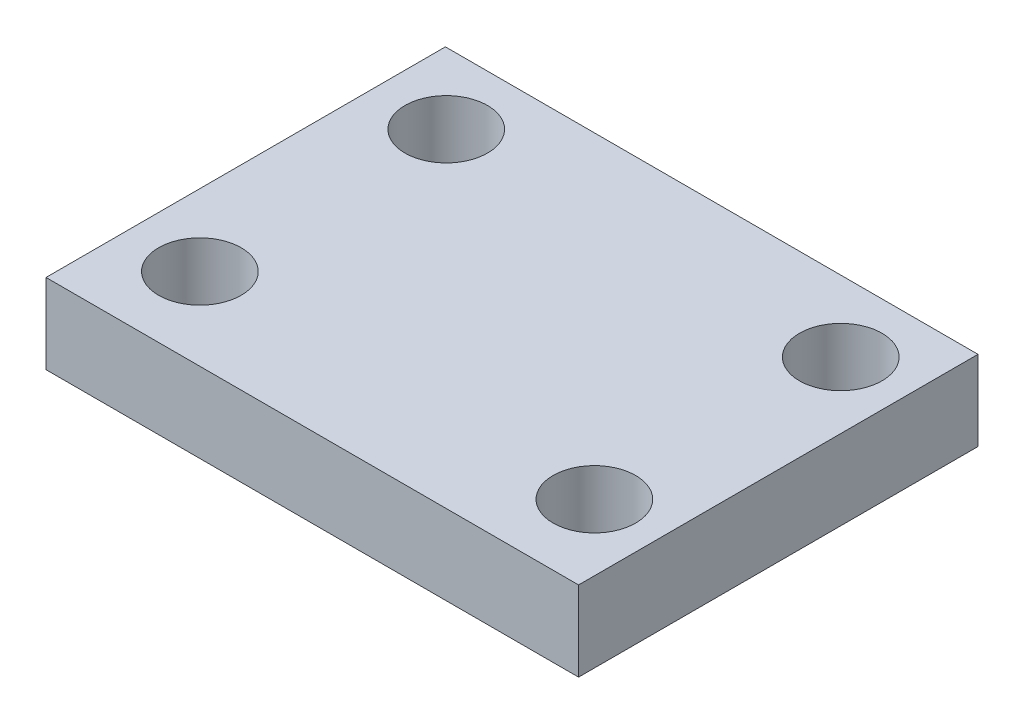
from build123d import *

# Parameters (mm, degrees)
SKETCH1_W                   = 100
SKETCH1_H                   = 75
EXTRUDE1_DEPTH              = 15
M15_5_15_5_DIAMETER_HOLE1_D = 15.5


with BuildPart() as part:
    # Sketch1 → Extrude1 (new body)
    with BuildSketch(Plane(origin=(0, 0, 0), x_dir=(1, 0, 0), z_dir=(0, 1, 0))):
        Rectangle(SKETCH1_W, SKETCH1_H)
    extrude(amount=EXTRUDE1_DEPTH)

    # M15.5 _15.5_ Diameter Hole1 (through all)
    with Locations(Plane(origin=(0, 15, 0), x_dir=(-1, 0, 0), z_dir=(0, 1, 0))):
        with Locations((36.516436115, 22.088353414), (36.516436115, -24.170757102), (-37.557637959, -24.170757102), (-37.557637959, 22.088353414)):
            Hole(M15_5_15_5_DIAMETER_HOLE1_D / 2)


solid = part.part
